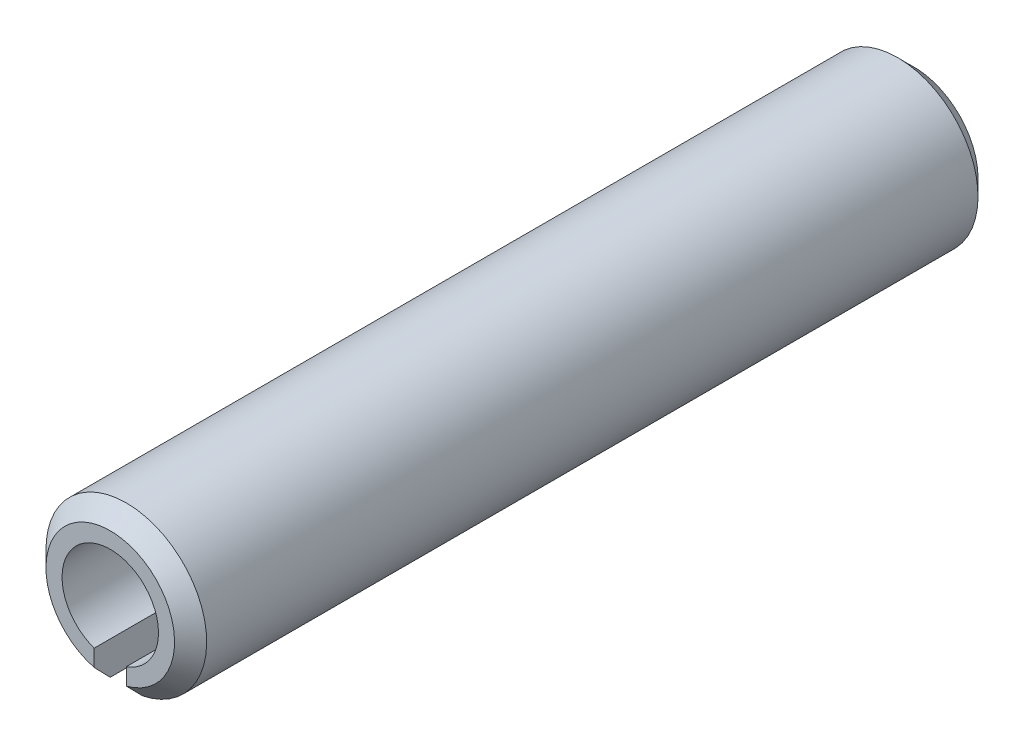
from build123d import *

# Parameters (mm, degrees)
EXTRUSION1_DEPTH = 50
CHANFREIN1_SIZE  = 1


with BuildPart() as part:
    # Esquisse1 → Extrusion1 (new body)
    with BuildSketch(Plane.XY):
        with BuildLine():
            Line((-1, -2.828427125), (-1, -4.898979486))
            ThreePointArc((-1, -4.898979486), (0, 5), (1, -4.898979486))
            Line((1, -4.898979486), (1, -2.828427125))
            ThreePointArc((1, -2.828427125), (0, 3), (-1, -2.828427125))
        make_face()
    extrude(amount=-EXTRUSION1_DEPTH)

    # Chanfrein1
    chanfrein1_edges = [part.edges().sort_by_distance(p)[0] for p in [
        (0, 5, -50),
        (0, 5, 0),
    ]]
    chamfer(chanfrein1_edges, length=CHANFREIN1_SIZE)


solid = part.part
